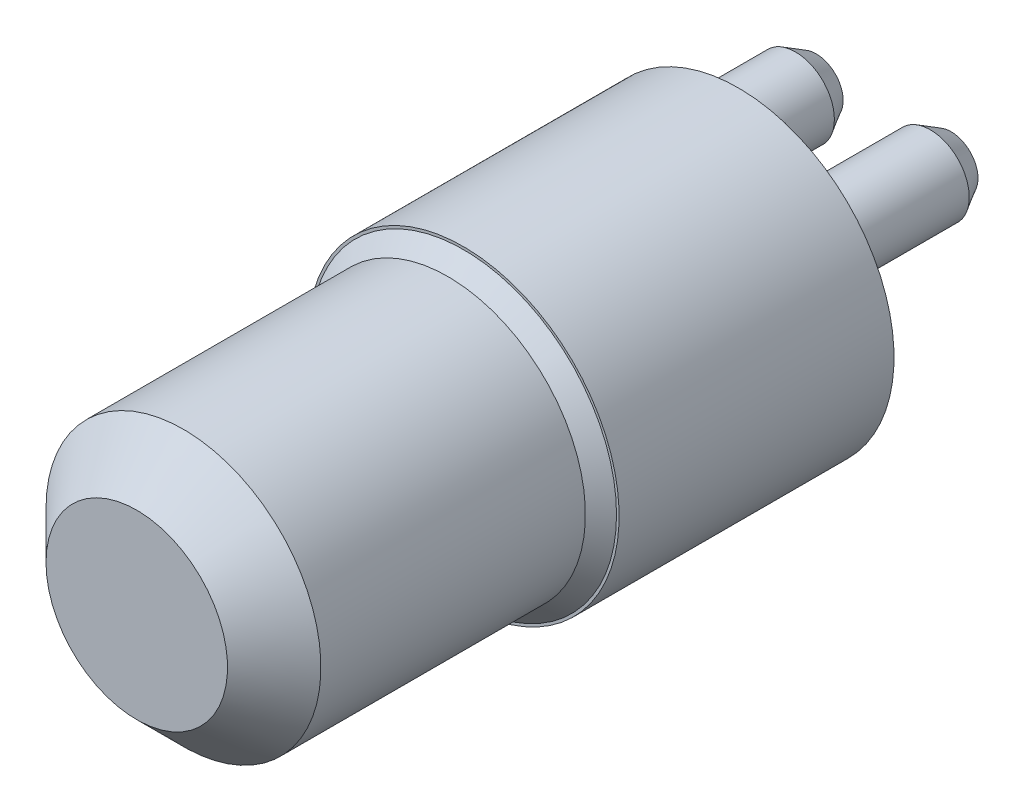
ISO-10303-21;
HEADER;
FILE_DESCRIPTION(('STEP AP214'),'2;1');
FILE_NAME('part.step','',(''),(''),'','','');
FILE_SCHEMA(('AUTOMOTIVE_DESIGN { 1 0 10303 214 1 1 1 1 }'));
ENDSEC;
DATA;
#1=APPLICATION_CONTEXT('core data for automotive mechanical design processes');
#2=APPLICATION_PROTOCOL_DEFINITION('international standard','automotive_design',2000,#1);
#3=PRODUCT_CONTEXT('',#1,'mechanical');
#4=PRODUCT('Part','Part','',(#3));
#5=PRODUCT_RELATED_PRODUCT_CATEGORY('part','',(#4));
#6=PRODUCT_DEFINITION_FORMATION('','',#4);
#7=PRODUCT_DEFINITION_CONTEXT('part definition',#1,'design');
#8=PRODUCT_DEFINITION('design','',#6,#7);
#9=PRODUCT_DEFINITION_SHAPE('','',#8);
#10=(LENGTH_UNIT() NAMED_UNIT(*) SI_UNIT(.MILLI.,.METRE.));
#11=(NAMED_UNIT(*) PLANE_ANGLE_UNIT() SI_UNIT($,.RADIAN.));
#12=(NAMED_UNIT(*) SI_UNIT($,.STERADIAN.) SOLID_ANGLE_UNIT());
#13=UNCERTAINTY_MEASURE_WITH_UNIT(LENGTH_MEASURE(1.E-05),#10,'distance_accuracy_value','');
#14=(GEOMETRIC_REPRESENTATION_CONTEXT(3) GLOBAL_UNCERTAINTY_ASSIGNED_CONTEXT((#13)) GLOBAL_UNIT_ASSIGNED_CONTEXT((#10,
#11,#12)) REPRESENTATION_CONTEXT('',''));
#15=CARTESIAN_POINT('',(0.,0.,0.));
#16=DIRECTION('',(0.,0.,1.));
#17=DIRECTION('',(1.,0.,0.));
#18=AXIS2_PLACEMENT_3D('',#15,#16,#17);
#19=CARTESIAN_POINT('',(0.,0.,0.));
#20=DIRECTION('',(0.,0.,0.999999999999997));
#21=DIRECTION('',(0.999999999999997,0.,0.));
#22=AXIS2_PLACEMENT_3D('',#19,#20,#21);
#23=PLANE('',#22);
#24=CARTESIAN_POINT('',(3.30199999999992,2.53999999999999,0.));
#25=DIRECTION('',(0.,0.,0.999999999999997));
#26=DIRECTION('',(0.999999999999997,0.,0.));
#27=AXIS2_PLACEMENT_3D('',#24,#25,#26);
#28=CIRCLE('',#27,1.905);
#29=CARTESIAN_POINT('',(5.20699999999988,2.54,0.));
#30=VERTEX_POINT('',#29);
#31=EDGE_CURVE('E57',#30,#30,#28,.F.);
#32=ORIENTED_EDGE('',*,*,#31,.F.);
#33=EDGE_LOOP('',(#32));
#34=FACE_BOUND('',#33,.T.);
#35=CARTESIAN_POINT('',(0.,0.,0.));
#36=DIRECTION('',(0.,0.,0.999999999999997));
#37=DIRECTION('',(0.999999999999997,0.,0.));
#38=AXIS2_PLACEMENT_3D('',#35,#36,#37);
#39=CIRCLE('',#38,7.62);
#40=CARTESIAN_POINT('',(-7.61999999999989,0.,0.));
#41=VERTEX_POINT('',#40);
#42=EDGE_CURVE('E67',#41,#41,#39,.T.);
#43=ORIENTED_EDGE('',*,*,#42,.F.);
#44=EDGE_LOOP('',(#43));
#45=FACE_BOUND('',#44,.T.);
#46=CARTESIAN_POINT('',(-3.30199999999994,2.54000000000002,0.));
#47=DIRECTION('',(0.,0.,0.999999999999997));
#48=DIRECTION('',(0.999999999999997,0.,0.));
#49=AXIS2_PLACEMENT_3D('',#46,#47,#48);
#50=CIRCLE('',#49,1.905);
#51=CARTESIAN_POINT('',(-1.397,2.54,0.));
#52=VERTEX_POINT('',#51);
#53=EDGE_CURVE('E54',#52,#52,#50,.F.);
#54=ORIENTED_EDGE('',*,*,#53,.F.);
#55=EDGE_LOOP('',(#54));
#56=FACE_BOUND('',#55,.T.);
#57=ADVANCED_FACE('F28',(#34,#45,#56),#23,.F.);
#58=CARTESIAN_POINT('',(0.,0.,13.462));
#59=DIRECTION('',(0.,0.,0.999999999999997));
#60=DIRECTION('',(0.999999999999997,0.,0.));
#61=AXIS2_PLACEMENT_3D('',#58,#59,#60);
#62=PLANE('',#61);
#63=CARTESIAN_POINT('',(0.,0.,13.462));
#64=DIRECTION('',(0.,0.,0.999999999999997));
#65=DIRECTION('',(0.999999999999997,0.,0.));
#66=AXIS2_PLACEMENT_3D('',#63,#64,#65);
#67=CIRCLE('',#66,7.49299999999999);
#68=CARTESIAN_POINT('',(-7.49299999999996,0.,13.462));
#69=VERTEX_POINT('',#68);
#70=EDGE_CURVE('E48',#69,#69,#67,.F.);
#71=ORIENTED_EDGE('',*,*,#70,.T.);
#72=EDGE_LOOP('',(#71));
#73=FACE_BOUND('',#72,.T.);
#74=CARTESIAN_POINT('',(0.,0.,13.462));
#75=DIRECTION('',(0.,0.,0.999999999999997));
#76=DIRECTION('',(0.999999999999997,0.,0.));
#77=AXIS2_PLACEMENT_3D('',#74,#75,#76);
#78=CIRCLE('',#77,7.62);
#79=CARTESIAN_POINT('',(-7.61999999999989,0.,13.462));
#80=VERTEX_POINT('',#79);
#81=EDGE_CURVE('E66',#80,#80,#78,.T.);
#82=ORIENTED_EDGE('',*,*,#81,.T.);
#83=EDGE_LOOP('',(#82));
#84=FACE_BOUND('',#83,.T.);
#85=ADVANCED_FACE('F73',(#73,#84),#62,.T.);
#86=CARTESIAN_POINT('',(0.,0.,13.462));
#87=DIRECTION('',(0.,0.,-0.999999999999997));
#88=DIRECTION('',(-0.999999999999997,0.,0.));
#89=AXIS2_PLACEMENT_3D('',#86,#87,#88);
#90=CYLINDRICAL_SURFACE('',#89,7.62);
#91=CARTESIAN_POINT('',(-7.61999999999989,0.,13.462));
#92=CARTESIAN_POINT('',(-7.61999999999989,0.,13.3217708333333));
#93=CARTESIAN_POINT('',(-7.61999999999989,0.,13.1815416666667));
#94=CARTESIAN_POINT('',(-7.61999999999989,0.,12.9010833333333));
#95=CARTESIAN_POINT('',(-7.61999999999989,0.,12.7608541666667));
#96=CARTESIAN_POINT('',(-7.61999999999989,0.,12.4803958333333));
#97=CARTESIAN_POINT('',(-7.61999999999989,0.,12.3401666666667));
#98=CARTESIAN_POINT('',(-7.61999999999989,0.,12.0597083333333));
#99=CARTESIAN_POINT('',(-7.61999999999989,0.,11.9194791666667));
#100=CARTESIAN_POINT('',(-7.61999999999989,0.,11.6390208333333));
#101=CARTESIAN_POINT('',(-7.61999999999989,0.,11.4987916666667));
#102=CARTESIAN_POINT('',(-7.61999999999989,0.,11.2183333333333));
#103=CARTESIAN_POINT('',(-7.61999999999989,0.,11.0781041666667));
#104=CARTESIAN_POINT('',(-7.61999999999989,0.,10.7976458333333));
#105=CARTESIAN_POINT('',(-7.61999999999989,0.,10.6574166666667));
#106=CARTESIAN_POINT('',(-7.61999999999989,0.,10.3769583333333));
#107=CARTESIAN_POINT('',(-7.61999999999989,0.,10.2367291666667));
#108=CARTESIAN_POINT('',(-7.61999999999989,0.,9.95627083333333));
#109=CARTESIAN_POINT('',(-7.61999999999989,0.,9.81604166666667));
#110=CARTESIAN_POINT('',(-7.61999999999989,0.,9.53558333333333));
#111=CARTESIAN_POINT('',(-7.61999999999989,0.,9.39535416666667));
#112=CARTESIAN_POINT('',(-7.61999999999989,0.,9.11489583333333));
#113=CARTESIAN_POINT('',(-7.61999999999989,0.,8.97466666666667));
#114=CARTESIAN_POINT('',(-7.61999999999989,0.,8.69420833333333));
#115=CARTESIAN_POINT('',(-7.61999999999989,0.,8.55397916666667));
#116=CARTESIAN_POINT('',(-7.61999999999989,0.,8.27352083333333));
#117=CARTESIAN_POINT('',(-7.61999999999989,0.,8.13329166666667));
#118=CARTESIAN_POINT('',(-7.61999999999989,0.,7.85283333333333));
#119=CARTESIAN_POINT('',(-7.61999999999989,0.,7.71260416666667));
#120=CARTESIAN_POINT('',(-7.61999999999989,0.,7.43214583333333));
#121=CARTESIAN_POINT('',(-7.61999999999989,0.,7.29191666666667));
#122=CARTESIAN_POINT('',(-7.61999999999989,0.,7.01145833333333));
#123=CARTESIAN_POINT('',(-7.61999999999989,0.,6.87122916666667));
#124=CARTESIAN_POINT('',(-7.61999999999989,0.,6.59077083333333));
#125=CARTESIAN_POINT('',(-7.61999999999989,0.,6.45054166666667));
#126=CARTESIAN_POINT('',(-7.61999999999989,0.,6.17008333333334));
#127=CARTESIAN_POINT('',(-7.61999999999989,0.,6.02985416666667));
#128=CARTESIAN_POINT('',(-7.61999999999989,0.,5.74939583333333));
#129=CARTESIAN_POINT('',(-7.61999999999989,0.,5.60916666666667));
#130=CARTESIAN_POINT('',(-7.61999999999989,0.,5.32870833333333));
#131=CARTESIAN_POINT('',(-7.61999999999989,0.,5.18847916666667));
#132=CARTESIAN_POINT('',(-7.61999999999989,0.,4.90802083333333));
#133=CARTESIAN_POINT('',(-7.61999999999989,0.,4.76779166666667));
#134=CARTESIAN_POINT('',(-7.61999999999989,0.,4.48733333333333));
#135=CARTESIAN_POINT('',(-7.61999999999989,0.,4.34710416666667));
#136=CARTESIAN_POINT('',(-7.61999999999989,0.,4.06664583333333));
#137=CARTESIAN_POINT('',(-7.61999999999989,0.,3.92641666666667));
#138=CARTESIAN_POINT('',(-7.61999999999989,0.,3.64595833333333));
#139=CARTESIAN_POINT('',(-7.61999999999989,0.,3.50572916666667));
#140=CARTESIAN_POINT('',(-7.61999999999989,0.,3.22527083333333));
#141=CARTESIAN_POINT('',(-7.61999999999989,0.,3.08504166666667));
#142=CARTESIAN_POINT('',(-7.61999999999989,0.,2.80458333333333));
#143=CARTESIAN_POINT('',(-7.61999999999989,0.,2.66435416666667));
#144=CARTESIAN_POINT('',(-7.61999999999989,0.,2.38389583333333));
#145=CARTESIAN_POINT('',(-7.61999999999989,0.,2.24366666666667));
#146=CARTESIAN_POINT('',(-7.61999999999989,0.,1.96320833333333));
#147=CARTESIAN_POINT('',(-7.61999999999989,0.,1.82297916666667));
#148=CARTESIAN_POINT('',(-7.61999999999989,0.,1.54252083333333));
#149=CARTESIAN_POINT('',(-7.61999999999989,0.,1.40229166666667));
#150=CARTESIAN_POINT('',(-7.61999999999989,0.,1.12183333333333));
#151=CARTESIAN_POINT('',(-7.61999999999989,0.,0.981604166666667));
#152=CARTESIAN_POINT('',(-7.61999999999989,0.,0.701145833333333));
#153=CARTESIAN_POINT('',(-7.61999999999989,0.,0.560916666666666));
#154=CARTESIAN_POINT('',(-7.61999999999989,0.,0.280458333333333));
#155=CARTESIAN_POINT('',(-7.61999999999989,0.,0.140229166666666));
#156=CARTESIAN_POINT('',(-7.61999999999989,0.,0.));
#157=B_SPLINE_CURVE_WITH_KNOTS('',3,(#91,#92,#93,#94,#95,#96,#97,#98,#99,#100,#101,#102,#103,
#104,#105,#106,#107,#108,#109,#110,#111,#112,#113,#114,#115,#116,#117,#118,#119,#120,#121,#122,
#123,#124,#125,#126,#127,#128,#129,#130,#131,#132,#133,#134,#135,#136,#137,#138,#139,#140,#141,
#142,#143,#144,#145,#146,#147,#148,#149,#150,#151,#152,#153,#154,#155,#156),.UNSPECIFIED.,.F.,
.F.,(4,2,2,2,2,2,2,2,2,2,2,2,2,2,2,2,2,2,2,2,2,2,2,2,2,2,2,2,2,2,2,2,4),(0.,0.420687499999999,
0.841374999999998,1.2620625,1.68275,2.1034375,2.524125,2.9448125,3.3655,3.7861875,4.206875,
4.6275625,5.04825,5.4689375,5.889625,6.3103125,6.731,7.1516875,7.572375,7.9930625,8.41375,
8.8344375,9.255125,9.6758125,10.0965,10.5171875,10.937875,11.3585625,11.77925,12.1999375,
12.620625,13.0413125,13.462),.UNSPECIFIED.);
#158=EDGE_CURVE('BSEAM75',#80,#41,#157,.T.);
#159=ORIENTED_EDGE('',*,*,#81,.F.);
#160=ORIENTED_EDGE('',*,*,#42,.T.);
#161=ORIENTED_EDGE('',*,*,#158,.T.);
#162=ORIENTED_EDGE('',*,*,#158,.F.);
#163=EDGE_LOOP('',(#159,#161,#160,#162));
#164=FACE_BOUND('',#163,.T.);
#165=ADVANCED_FACE('F75',(#164),#90,.T.);
#166=CARTESIAN_POINT('',(0.,0.,29.464));
#167=DIRECTION('',(0.,0.,-0.999999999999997));
#168=DIRECTION('',(-0.999999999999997,0.,0.));
#169=AXIS2_PLACEMENT_3D('',#166,#167,#168);
#170=CYLINDRICAL_SURFACE('',#169,6.731);
#171=CARTESIAN_POINT('',(0.,0.,14.224));
#172=DIRECTION('',(0.,0.,0.999999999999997));
#173=DIRECTION('',(0.999999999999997,0.,0.));
#174=AXIS2_PLACEMENT_3D('',#171,#172,#173);
#175=CIRCLE('',#174,6.731);
#176=CARTESIAN_POINT('',(-6.73099999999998,0.,14.224));
#177=VERTEX_POINT('',#176);
#178=EDGE_CURVE('E51',#177,#177,#175,.T.);
#179=CARTESIAN_POINT('',(0.,0.,27.178));
#180=DIRECTION('',(0.,0.,0.999999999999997));
#181=DIRECTION('',(0.999999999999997,0.,0.));
#182=AXIS2_PLACEMENT_3D('',#179,#180,#181);
#183=CIRCLE('',#182,6.731);
#184=CARTESIAN_POINT('',(-6.73099999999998,0.,27.178));
#185=VERTEX_POINT('',#184);
#186=EDGE_CURVE('E60',#185,#185,#183,.F.);
#187=CARTESIAN_POINT('',(-6.73099999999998,0.,14.224));
#188=CARTESIAN_POINT('',(-6.73099999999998,0.,14.3589375));
#189=CARTESIAN_POINT('',(-6.73099999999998,0.,14.493875));
#190=CARTESIAN_POINT('',(-6.73099999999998,0.,14.76375));
#191=CARTESIAN_POINT('',(-6.73099999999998,0.,14.8986875));
#192=CARTESIAN_POINT('',(-6.73099999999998,0.,15.1685625));
#193=CARTESIAN_POINT('',(-6.73099999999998,0.,15.3035));
#194=CARTESIAN_POINT('',(-6.73099999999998,0.,15.573375));
#195=CARTESIAN_POINT('',(-6.73099999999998,0.,15.7083125));
#196=CARTESIAN_POINT('',(-6.73099999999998,0.,15.9781875));
#197=CARTESIAN_POINT('',(-6.73099999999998,0.,16.113125));
#198=CARTESIAN_POINT('',(-6.73099999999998,0.,16.383));
#199=CARTESIAN_POINT('',(-6.73099999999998,0.,16.5179375));
#200=CARTESIAN_POINT('',(-6.73099999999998,0.,16.7878125));
#201=CARTESIAN_POINT('',(-6.73099999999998,0.,16.92275));
#202=CARTESIAN_POINT('',(-6.73099999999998,0.,17.192625));
#203=CARTESIAN_POINT('',(-6.73099999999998,0.,17.3275625));
#204=CARTESIAN_POINT('',(-6.73099999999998,0.,17.5974375));
#205=CARTESIAN_POINT('',(-6.73099999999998,0.,17.732375));
#206=CARTESIAN_POINT('',(-6.73099999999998,0.,18.00225));
#207=CARTESIAN_POINT('',(-6.73099999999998,0.,18.1371875));
#208=CARTESIAN_POINT('',(-6.73099999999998,0.,18.4070625));
#209=CARTESIAN_POINT('',(-6.73099999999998,0.,18.542));
#210=CARTESIAN_POINT('',(-6.73099999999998,0.,18.811875));
#211=CARTESIAN_POINT('',(-6.73099999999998,0.,18.9468125));
#212=CARTESIAN_POINT('',(-6.73099999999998,0.,19.2166875));
#213=CARTESIAN_POINT('',(-6.73099999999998,0.,19.351625));
#214=CARTESIAN_POINT('',(-6.73099999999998,0.,19.6215));
#215=CARTESIAN_POINT('',(-6.73099999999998,0.,19.7564375));
#216=CARTESIAN_POINT('',(-6.73099999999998,0.,20.0263125));
#217=CARTESIAN_POINT('',(-6.73099999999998,0.,20.16125));
#218=CARTESIAN_POINT('',(-6.73099999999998,0.,20.431125));
#219=CARTESIAN_POINT('',(-6.73099999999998,0.,20.5660625));
#220=CARTESIAN_POINT('',(-6.73099999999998,0.,20.8359375));
#221=CARTESIAN_POINT('',(-6.73099999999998,0.,20.970875));
#222=CARTESIAN_POINT('',(-6.73099999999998,0.,21.24075));
#223=CARTESIAN_POINT('',(-6.73099999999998,0.,21.3756875));
#224=CARTESIAN_POINT('',(-6.73099999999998,0.,21.6455625));
#225=CARTESIAN_POINT('',(-6.73099999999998,0.,21.7805));
#226=CARTESIAN_POINT('',(-6.73099999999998,0.,22.050375));
#227=CARTESIAN_POINT('',(-6.73099999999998,0.,22.1853125));
#228=CARTESIAN_POINT('',(-6.73099999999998,0.,22.4551875));
#229=CARTESIAN_POINT('',(-6.73099999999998,0.,22.590125));
#230=CARTESIAN_POINT('',(-6.73099999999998,0.,22.86));
#231=CARTESIAN_POINT('',(-6.73099999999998,0.,22.9949375));
#232=CARTESIAN_POINT('',(-6.73099999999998,0.,23.2648125));
#233=CARTESIAN_POINT('',(-6.73099999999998,0.,23.39975));
#234=CARTESIAN_POINT('',(-6.73099999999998,0.,23.669625));
#235=CARTESIAN_POINT('',(-6.73099999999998,0.,23.8045625));
#236=CARTESIAN_POINT('',(-6.73099999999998,0.,24.0744375));
#237=CARTESIAN_POINT('',(-6.73099999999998,0.,24.209375));
#238=CARTESIAN_POINT('',(-6.73099999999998,0.,24.47925));
#239=CARTESIAN_POINT('',(-6.73099999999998,0.,24.6141875));
#240=CARTESIAN_POINT('',(-6.73099999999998,0.,24.8840625));
#241=CARTESIAN_POINT('',(-6.73099999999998,0.,25.019));
#242=CARTESIAN_POINT('',(-6.73099999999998,0.,25.288875));
#243=CARTESIAN_POINT('',(-6.73099999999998,0.,25.4238125));
#244=CARTESIAN_POINT('',(-6.73099999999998,0.,25.6936875));
#245=CARTESIAN_POINT('',(-6.73099999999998,0.,25.828625));
#246=CARTESIAN_POINT('',(-6.73099999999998,0.,26.0985));
#247=CARTESIAN_POINT('',(-6.73099999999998,0.,26.2334375));
#248=CARTESIAN_POINT('',(-6.73099999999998,0.,26.5033125));
#249=CARTESIAN_POINT('',(-6.73099999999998,0.,26.63825));
#250=CARTESIAN_POINT('',(-6.73099999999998,0.,26.908125));
#251=CARTESIAN_POINT('',(-6.73099999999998,0.,27.0430625));
#252=CARTESIAN_POINT('',(-6.73099999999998,0.,27.178));
#253=B_SPLINE_CURVE_WITH_KNOTS('',3,(#187,#188,#189,#190,#191,#192,#193,#194,#195,#196,#197,
#198,#199,#200,#201,#202,#203,#204,#205,#206,#207,#208,#209,#210,#211,#212,#213,#214,#215,#216,
#217,#218,#219,#220,#221,#222,#223,#224,#225,#226,#227,#228,#229,#230,#231,#232,#233,#234,#235,
#236,#237,#238,#239,#240,#241,#242,#243,#244,#245,#246,#247,#248,#249,#250,#251,#252),
.UNSPECIFIED.,.F.,.F.,(4,2,2,2,2,2,2,2,2,2,2,2,2,2,2,2,2,2,2,2,2,2,2,2,2,2,2,2,2,2,2,2,4),(0.,
0.404812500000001,0.809624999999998,1.2144375,1.61925,2.02406249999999,2.42887499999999,
2.83368749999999,3.23849999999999,3.64331249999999,4.04812499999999,4.45293749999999,
4.85774999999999,5.26256249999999,5.66737499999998,6.07218749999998,6.47699999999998,
6.88181249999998,7.28662499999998,7.69143749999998,8.09624999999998,8.50106249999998,
8.90587499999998,9.31068749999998,9.71549999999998,10.1203125,10.525125,10.9299375,11.33475,
11.7395625,12.144375,12.5491875,12.954),.UNSPECIFIED.);
#254=EDGE_CURVE('BSEAM78',#177,#185,#253,.T.);
#255=ORIENTED_EDGE('',*,*,#178,.T.);
#256=ORIENTED_EDGE('',*,*,#186,.T.);
#257=ORIENTED_EDGE('',*,*,#254,.T.);
#258=ORIENTED_EDGE('',*,*,#254,.F.);
#259=EDGE_LOOP('',(#255,#257,#256,#258));
#260=FACE_BOUND('',#259,.T.);
#261=ADVANCED_FACE('F78',(#260),#170,.T.);
#262=CARTESIAN_POINT('',(0.,0.,29.464));
#263=DIRECTION('',(0.,0.,0.999999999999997));
#264=DIRECTION('',(0.999999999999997,0.,0.));
#265=AXIS2_PLACEMENT_3D('',#262,#263,#264);
#266=PLANE('',#265);
#267=CARTESIAN_POINT('',(0.,0.,29.464));
#268=DIRECTION('',(0.,0.,0.999999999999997));
#269=DIRECTION('',(0.999999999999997,0.,0.));
#270=AXIS2_PLACEMENT_3D('',#267,#268,#269);
#271=CIRCLE('',#270,4.44499999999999);
#272=CARTESIAN_POINT('',(-4.44499999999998,0.,29.464));
#273=VERTEX_POINT('',#272);
#274=EDGE_CURVE('E63',#273,#273,#271,.T.);
#275=ORIENTED_EDGE('',*,*,#274,.T.);
#276=EDGE_LOOP('',(#275));
#277=FACE_BOUND('',#276,.T.);
#278=ADVANCED_FACE('F107',(#277),#266,.T.);
#279=CARTESIAN_POINT('',(0.,0.,29.464));
#280=DIRECTION('',(0.,0.,-0.999999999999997));
#281=DIRECTION('',(-0.999999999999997,0.,0.));
#282=AXIS2_PLACEMENT_3D('',#279,#280,#281);
#283=CONICAL_SURFACE('',#282,4.44499999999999,0.785398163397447);
#284=CARTESIAN_POINT('',(-6.73099999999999,0.,27.178));
#285=CARTESIAN_POINT('',(-6.70718749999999,0.,27.2018125));
#286=CARTESIAN_POINT('',(-6.68337499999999,0.,27.225625));
#287=CARTESIAN_POINT('',(-6.63574999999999,0.,27.27325));
#288=CARTESIAN_POINT('',(-6.61193749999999,0.,27.2970625));
#289=CARTESIAN_POINT('',(-6.56431249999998,0.,27.3446875));
#290=CARTESIAN_POINT('',(-6.54049999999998,0.,27.3685));
#291=CARTESIAN_POINT('',(-6.49287499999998,0.,27.416125));
#292=CARTESIAN_POINT('',(-6.46906249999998,0.,27.4399375));
#293=CARTESIAN_POINT('',(-6.42143749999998,0.,27.4875625));
#294=CARTESIAN_POINT('',(-6.39762499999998,0.,27.511375));
#295=CARTESIAN_POINT('',(-6.34999999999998,0.,27.559));
#296=CARTESIAN_POINT('',(-6.32618749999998,0.,27.5828125));
#297=CARTESIAN_POINT('',(-6.27856249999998,0.,27.6304375));
#298=CARTESIAN_POINT('',(-6.25474999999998,0.,27.65425));
#299=CARTESIAN_POINT('',(-6.20712499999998,0.,27.701875));
#300=CARTESIAN_POINT('',(-6.18331249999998,0.,27.7256875));
#301=CARTESIAN_POINT('',(-6.13568749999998,0.,27.7733125));
#302=CARTESIAN_POINT('',(-6.11187499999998,0.,27.797125));
#303=CARTESIAN_POINT('',(-6.06424999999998,0.,27.84475));
#304=CARTESIAN_POINT('',(-6.04043749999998,0.,27.8685625));
#305=CARTESIAN_POINT('',(-5.99281249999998,0.,27.9161875));
#306=CARTESIAN_POINT('',(-5.96899999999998,0.,27.94));
#307=CARTESIAN_POINT('',(-5.92137499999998,0.,27.987625));
#308=CARTESIAN_POINT('',(-5.89756249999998,0.,28.0114375));
#309=CARTESIAN_POINT('',(-5.84993749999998,0.,28.0590625));
#310=CARTESIAN_POINT('',(-5.82612499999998,0.,28.082875));
#311=CARTESIAN_POINT('',(-5.77849999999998,0.,28.1305));
#312=CARTESIAN_POINT('',(-5.75468749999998,0.,28.1543125));
#313=CARTESIAN_POINT('',(-5.70706249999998,0.,28.2019375));
#314=CARTESIAN_POINT('',(-5.68324999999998,0.,28.22575));
#315=CARTESIAN_POINT('',(-5.63562499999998,0.,28.273375));
#316=CARTESIAN_POINT('',(-5.61181249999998,0.,28.2971875));
#317=CARTESIAN_POINT('',(-5.56418749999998,0.,28.3448125));
#318=CARTESIAN_POINT('',(-5.54037499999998,0.,28.368625));
#319=CARTESIAN_POINT('',(-5.49274999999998,0.,28.41625));
#320=CARTESIAN_POINT('',(-5.46893749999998,0.,28.4400625));
#321=CARTESIAN_POINT('',(-5.42131249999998,0.,28.4876875));
#322=CARTESIAN_POINT('',(-5.39749999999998,0.,28.5115));
#323=CARTESIAN_POINT('',(-5.34987499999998,0.,28.559125));
#324=CARTESIAN_POINT('',(-5.32606249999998,0.,28.5829375));
#325=CARTESIAN_POINT('',(-5.27843749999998,0.,28.6305625));
#326=CARTESIAN_POINT('',(-5.25462499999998,0.,28.654375));
#327=CARTESIAN_POINT('',(-5.20699999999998,0.,28.702));
#328=CARTESIAN_POINT('',(-5.18318749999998,0.,28.7258125));
#329=CARTESIAN_POINT('',(-5.13556249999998,0.,28.7734375));
#330=CARTESIAN_POINT('',(-5.11174999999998,0.,28.79725));
#331=CARTESIAN_POINT('',(-5.06412499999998,0.,28.844875));
#332=CARTESIAN_POINT('',(-5.04031249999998,0.,28.8686875));
#333=CARTESIAN_POINT('',(-4.99268749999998,0.,28.9163125));
#334=CARTESIAN_POINT('',(-4.96887499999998,0.,28.940125));
#335=CARTESIAN_POINT('',(-4.92124999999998,0.,28.98775));
#336=CARTESIAN_POINT('',(-4.89743749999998,0.,29.0115625));
#337=CARTESIAN_POINT('',(-4.84981249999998,0.,29.0591875));
#338=CARTESIAN_POINT('',(-4.82599999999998,0.,29.083));
#339=CARTESIAN_POINT('',(-4.77837499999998,0.,29.130625));
#340=CARTESIAN_POINT('',(-4.75456249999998,0.,29.1544375));
#341=CARTESIAN_POINT('',(-4.70693749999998,0.,29.2020625));
#342=CARTESIAN_POINT('',(-4.68312499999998,0.,29.225875));
#343=CARTESIAN_POINT('',(-4.63549999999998,0.,29.2735));
#344=CARTESIAN_POINT('',(-4.61168749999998,0.,29.2973125));
#345=CARTESIAN_POINT('',(-4.56406249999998,0.,29.3449375));
#346=CARTESIAN_POINT('',(-4.54024999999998,0.,29.36875));
#347=CARTESIAN_POINT('',(-4.49262499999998,0.,29.416375));
#348=CARTESIAN_POINT('',(-4.46881249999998,0.,29.4401875));
#349=CARTESIAN_POINT('',(-4.44499999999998,0.,29.464));
#350=B_SPLINE_CURVE_WITH_KNOTS('',3,(#284,#285,#286,#287,#288,#289,#290,#291,#292,#293,#294,
#295,#296,#297,#298,#299,#300,#301,#302,#303,#304,#305,#306,#307,#308,#309,#310,#311,#312,#313,
#314,#315,#316,#317,#318,#319,#320,#321,#322,#323,#324,#325,#326,#327,#328,#329,#330,#331,#332,
#333,#334,#335,#336,#337,#338,#339,#340,#341,#342,#343,#344,#345,#346,#347,#348,#349),
.UNSPECIFIED.,.F.,.F.,(4,2,2,2,2,2,2,2,2,2,2,2,2,2,2,2,2,2,2,2,2,2,2,2,2,2,2,2,2,2,2,2,4),(0.,
0.101027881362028,0.202055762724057,0.303083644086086,0.404111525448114,0.505139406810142,
0.606167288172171,0.707195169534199,0.808223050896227,0.909250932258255,1.01027881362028,
1.11130669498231,1.21233457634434,1.31336245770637,1.4143903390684,1.51541822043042,
1.61644610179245,1.71747398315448,1.81850186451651,1.91952974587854,2.02055762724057,
2.12158550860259,2.22261338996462,2.32364127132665,2.42466915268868,2.52569703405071,
2.62672491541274,2.72775279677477,2.82878067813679,2.92980855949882,3.03083644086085,
3.13186432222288,3.23289220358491),.UNSPECIFIED.);
#351=EDGE_CURVE('BSEAM106',#185,#273,#350,.T.);
#352=ORIENTED_EDGE('',*,*,#186,.F.);
#353=ORIENTED_EDGE('',*,*,#274,.F.);
#354=ORIENTED_EDGE('',*,*,#351,.T.);
#355=ORIENTED_EDGE('',*,*,#351,.F.);
#356=EDGE_LOOP('',(#352,#354,#353,#355));
#357=FACE_BOUND('',#356,.T.);
#358=ADVANCED_FACE('F106',(#357),#283,.T.);
#359=CARTESIAN_POINT('',(3.30199999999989,2.54,-7.11199999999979));
#360=DIRECTION('',(0.,0.,0.999999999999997));
#361=DIRECTION('',(0.999999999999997,0.,0.));
#362=AXIS2_PLACEMENT_3D('',#359,#360,#361);
#363=CYLINDRICAL_SURFACE('',#362,1.905);
#364=CARTESIAN_POINT('',(3.30199999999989,2.54,-6.0959999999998));
#365=DIRECTION('',(0.,0.,-0.999999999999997));
#366=DIRECTION('',(-0.999999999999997,0.,0.));
#367=AXIS2_PLACEMENT_3D('',#364,#365,#366);
#368=CIRCLE('',#367,1.905);
#369=CARTESIAN_POINT('',(5.20699999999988,2.54,-6.09599999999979));
#370=VERTEX_POINT('',#369);
#371=EDGE_CURVE('E10',#370,#370,#368,.F.);
#372=CARTESIAN_POINT('',(5.20699999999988,2.54,-6.09599999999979));
#373=CARTESIAN_POINT('',(5.20699999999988,2.54,-6.0324999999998));
#374=CARTESIAN_POINT('',(5.20699999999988,2.54,-5.9689999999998));
#375=CARTESIAN_POINT('',(5.20699999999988,2.54,-5.8419999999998));
#376=CARTESIAN_POINT('',(5.20699999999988,2.54,-5.77849999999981));
#377=CARTESIAN_POINT('',(5.20699999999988,2.54,-5.65149999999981));
#378=CARTESIAN_POINT('',(5.20699999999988,2.54,-5.58799999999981));
#379=CARTESIAN_POINT('',(5.20699999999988,2.54,-5.46099999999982));
#380=CARTESIAN_POINT('',(5.20699999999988,2.54,-5.39749999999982));
#381=CARTESIAN_POINT('',(5.20699999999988,2.54,-5.27049999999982));
#382=CARTESIAN_POINT('',(5.20699999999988,2.54,-5.20699999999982));
#383=CARTESIAN_POINT('',(5.20699999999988,2.54,-5.07999999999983));
#384=CARTESIAN_POINT('',(5.20699999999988,2.54,-5.01649999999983));
#385=CARTESIAN_POINT('',(5.20699999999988,2.54,-4.88949999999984));
#386=CARTESIAN_POINT('',(5.20699999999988,2.54,-4.82599999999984));
#387=CARTESIAN_POINT('',(5.20699999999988,2.54,-4.69899999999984));
#388=CARTESIAN_POINT('',(5.20699999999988,2.54,-4.63549999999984));
#389=CARTESIAN_POINT('',(5.20699999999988,2.54,-4.50849999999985));
#390=CARTESIAN_POINT('',(5.20699999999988,2.54,-4.44499999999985));
#391=CARTESIAN_POINT('',(5.20699999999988,2.54,-4.31799999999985));
#392=CARTESIAN_POINT('',(5.20699999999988,2.54,-4.25449999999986));
#393=CARTESIAN_POINT('',(5.20699999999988,2.54,-4.12749999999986));
#394=CARTESIAN_POINT('',(5.20699999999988,2.54,-4.06399999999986));
#395=CARTESIAN_POINT('',(5.20699999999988,2.54,-3.93699999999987));
#396=CARTESIAN_POINT('',(5.20699999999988,2.54,-3.87349999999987));
#397=CARTESIAN_POINT('',(5.20699999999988,2.54,-3.74649999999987));
#398=CARTESIAN_POINT('',(5.20699999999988,2.54,-3.68299999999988));
#399=CARTESIAN_POINT('',(5.20699999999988,2.54,-3.55599999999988));
#400=CARTESIAN_POINT('',(5.20699999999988,2.54,-3.49249999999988));
#401=CARTESIAN_POINT('',(5.20699999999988,2.54,-3.36549999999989));
#402=CARTESIAN_POINT('',(5.20699999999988,2.54,-3.30199999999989));
#403=CARTESIAN_POINT('',(5.20699999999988,2.54,-3.17499999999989));
#404=CARTESIAN_POINT('',(5.20699999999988,2.54,-3.1114999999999));
#405=CARTESIAN_POINT('',(5.20699999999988,2.54,-2.9844999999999));
#406=CARTESIAN_POINT('',(5.20699999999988,2.54,-2.9209999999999));
#407=CARTESIAN_POINT('',(5.20699999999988,2.54,-2.79399999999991));
#408=CARTESIAN_POINT('',(5.20699999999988,2.54,-2.73049999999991));
#409=CARTESIAN_POINT('',(5.20699999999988,2.54,-2.60349999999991));
#410=CARTESIAN_POINT('',(5.20699999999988,2.54,-2.53999999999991));
#411=CARTESIAN_POINT('',(5.20699999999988,2.54,-2.41299999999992));
#412=CARTESIAN_POINT('',(5.20699999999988,2.54,-2.34949999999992));
#413=CARTESIAN_POINT('',(5.20699999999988,2.54,-2.22249999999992));
#414=CARTESIAN_POINT('',(5.20699999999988,2.54,-2.15899999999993));
#415=CARTESIAN_POINT('',(5.20699999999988,2.54,-2.03199999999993));
#416=CARTESIAN_POINT('',(5.20699999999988,2.54,-1.96849999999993));
#417=CARTESIAN_POINT('',(5.20699999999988,2.54,-1.84149999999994));
#418=CARTESIAN_POINT('',(5.20699999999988,2.54,-1.77799999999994));
#419=CARTESIAN_POINT('',(5.20699999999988,2.54,-1.65099999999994));
#420=CARTESIAN_POINT('',(5.20699999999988,2.54,-1.58749999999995));
#421=CARTESIAN_POINT('',(5.20699999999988,2.54,-1.46049999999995));
#422=CARTESIAN_POINT('',(5.20699999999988,2.54,-1.39699999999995));
#423=CARTESIAN_POINT('',(5.20699999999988,2.54,-1.26999999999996));
#424=CARTESIAN_POINT('',(5.20699999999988,2.54,-1.20649999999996));
#425=CARTESIAN_POINT('',(5.20699999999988,2.54,-1.07949999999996));
#426=CARTESIAN_POINT('',(5.20699999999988,2.54,-1.01599999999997));
#427=CARTESIAN_POINT('',(5.20699999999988,2.54,-0.888999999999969));
#428=CARTESIAN_POINT('',(5.20699999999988,2.54,-0.825499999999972));
#429=CARTESIAN_POINT('',(5.20699999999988,2.54,-0.698499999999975));
#430=CARTESIAN_POINT('',(5.20699999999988,2.54,-0.634999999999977));
#431=CARTESIAN_POINT('',(5.20699999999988,2.54,-0.507999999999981));
#432=CARTESIAN_POINT('',(5.20699999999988,2.54,-0.444499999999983));
#433=CARTESIAN_POINT('',(5.20699999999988,2.54,-0.317499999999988));
#434=CARTESIAN_POINT('',(5.20699999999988,2.54,-0.253999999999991));
#435=CARTESIAN_POINT('',(5.20699999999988,2.54,-0.126999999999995));
#436=CARTESIAN_POINT('',(5.20699999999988,2.54,-0.0634999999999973));
#437=CARTESIAN_POINT('',(5.20699999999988,2.54,0.));
#438=B_SPLINE_CURVE_WITH_KNOTS('',3,(#372,#373,#374,#375,#376,#377,#378,#379,#380,#381,#382,
#383,#384,#385,#386,#387,#388,#389,#390,#391,#392,#393,#394,#395,#396,#397,#398,#399,#400,#401,
#402,#403,#404,#405,#406,#407,#408,#409,#410,#411,#412,#413,#414,#415,#416,#417,#418,#419,#420,
#421,#422,#423,#424,#425,#426,#427,#428,#429,#430,#431,#432,#433,#434,#435,#436,#437),
.UNSPECIFIED.,.F.,.F.,(4,2,2,2,2,2,2,2,2,2,2,2,2,2,2,2,2,2,2,2,2,2,2,2,2,2,2,2,2,2,2,2,4),(0.,
0.190499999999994,0.380999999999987,0.571499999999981,0.761999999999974,0.952499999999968,
1.14299999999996,1.33349999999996,1.52399999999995,1.71449999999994,1.90499999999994,
2.09549999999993,2.28599999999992,2.47649999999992,2.66699999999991,2.8574999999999,
3.0479999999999,3.23849999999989,3.42899999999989,3.61949999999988,3.80999999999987,
4.00049999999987,4.19099999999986,4.38149999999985,4.57199999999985,4.76249999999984,
4.95299999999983,5.14349999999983,5.33399999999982,5.52449999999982,5.71499999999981,
5.9054999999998,6.0959999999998),.UNSPECIFIED.);
#439=EDGE_CURVE('BSEAM101',#370,#30,#438,.T.);
#440=ORIENTED_EDGE('',*,*,#371,.T.);
#441=ORIENTED_EDGE('',*,*,#31,.T.);
#442=ORIENTED_EDGE('',*,*,#439,.T.);
#443=ORIENTED_EDGE('',*,*,#439,.F.);
#444=EDGE_LOOP('',(#440,#442,#441,#443));
#445=FACE_BOUND('',#444,.T.);
#446=ADVANCED_FACE('F101',(#445),#363,.T.);
#447=CARTESIAN_POINT('',(3.30199999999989,2.54,-7.11199999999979));
#448=DIRECTION('',(0.,0.,-0.999999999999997));
#449=DIRECTION('',(-0.999999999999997,0.,0.));
#450=AXIS2_PLACEMENT_3D('',#447,#448,#449);
#451=PLANE('',#450);
#452=CARTESIAN_POINT('',(3.30199999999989,2.54,-7.11199999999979));
#453=DIRECTION('',(0.,0.,-0.999999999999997));
#454=DIRECTION('',(-0.999999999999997,0.,0.));
#455=AXIS2_PLACEMENT_3D('',#452,#453,#454);
#456=CIRCLE('',#455,1.31841212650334);
#457=CARTESIAN_POINT('',(4.62041212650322,2.54,-7.11199999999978));
#458=VERTEX_POINT('',#457);
#459=EDGE_CURVE('E35',#458,#458,#456,.T.);
#460=ORIENTED_EDGE('',*,*,#459,.T.);
#461=EDGE_LOOP('',(#460));
#462=FACE_BOUND('',#461,.T.);
#463=ADVANCED_FACE('F91',(#462),#451,.T.);
#464=CARTESIAN_POINT('',(-3.30199999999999,2.54,-7.11200000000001));
#465=DIRECTION('',(0.,0.,0.999999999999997));
#466=DIRECTION('',(0.999999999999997,0.,0.));
#467=AXIS2_PLACEMENT_3D('',#464,#465,#466);
#468=CYLINDRICAL_SURFACE('',#467,1.905);
#469=CARTESIAN_POINT('',(-3.30199999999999,2.54,-6.09599999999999));
#470=DIRECTION('',(0.,0.,0.999999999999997));
#471=DIRECTION('',(0.999999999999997,0.,0.));
#472=AXIS2_PLACEMENT_3D('',#469,#470,#471);
#473=CIRCLE('',#472,1.905);
#474=CARTESIAN_POINT('',(-1.397,2.54,-6.09599999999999));
#475=VERTEX_POINT('',#474);
#476=EDGE_CURVE('E39',#475,#475,#473,.T.);
#477=CARTESIAN_POINT('',(-1.397,2.54,-6.09599999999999));
#478=CARTESIAN_POINT('',(-1.397,2.54,-6.03249999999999));
#479=CARTESIAN_POINT('',(-1.397,2.54,-5.96899999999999));
#480=CARTESIAN_POINT('',(-1.397,2.54,-5.84199999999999));
#481=CARTESIAN_POINT('',(-1.397,2.54,-5.77849999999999));
#482=CARTESIAN_POINT('',(-1.397,2.54,-5.65149999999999));
#483=CARTESIAN_POINT('',(-1.397,2.54,-5.58799999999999));
#484=CARTESIAN_POINT('',(-1.397,2.54,-5.46099999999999));
#485=CARTESIAN_POINT('',(-1.397,2.54,-5.39749999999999));
#486=CARTESIAN_POINT('',(-1.397,2.54,-5.27049999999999));
#487=CARTESIAN_POINT('',(-1.397,2.54,-5.20699999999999));
#488=CARTESIAN_POINT('',(-1.397,2.54,-5.07999999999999));
#489=CARTESIAN_POINT('',(-1.397,2.54,-5.01649999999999));
#490=CARTESIAN_POINT('',(-1.397,2.54,-4.88949999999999));
#491=CARTESIAN_POINT('',(-1.397,2.54,-4.82599999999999));
#492=CARTESIAN_POINT('',(-1.397,2.54,-4.69899999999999));
#493=CARTESIAN_POINT('',(-1.397,2.54,-4.63549999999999));
#494=CARTESIAN_POINT('',(-1.397,2.54,-4.50849999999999));
#495=CARTESIAN_POINT('',(-1.397,2.54,-4.44499999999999));
#496=CARTESIAN_POINT('',(-1.397,2.54,-4.31799999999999));
#497=CARTESIAN_POINT('',(-1.397,2.54,-4.25449999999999));
#498=CARTESIAN_POINT('',(-1.397,2.54,-4.12749999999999));
#499=CARTESIAN_POINT('',(-1.397,2.54,-4.06399999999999));
#500=CARTESIAN_POINT('',(-1.397,2.54,-3.93699999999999));
#501=CARTESIAN_POINT('',(-1.397,2.54,-3.87349999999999));
#502=CARTESIAN_POINT('',(-1.397,2.54,-3.74649999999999));
#503=CARTESIAN_POINT('',(-1.397,2.54,-3.68299999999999));
#504=CARTESIAN_POINT('',(-1.397,2.54,-3.55599999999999));
#505=CARTESIAN_POINT('',(-1.397,2.54,-3.49249999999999));
#506=CARTESIAN_POINT('',(-1.397,2.54,-3.36549999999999));
#507=CARTESIAN_POINT('',(-1.397,2.54,-3.30199999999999));
#508=CARTESIAN_POINT('',(-1.397,2.54,-3.17499999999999));
#509=CARTESIAN_POINT('',(-1.397,2.54,-3.11149999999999));
#510=CARTESIAN_POINT('',(-1.397,2.54,-2.98449999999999));
#511=CARTESIAN_POINT('',(-1.397,2.54,-2.92099999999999));
#512=CARTESIAN_POINT('',(-1.397,2.54,-2.79399999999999));
#513=CARTESIAN_POINT('',(-1.397,2.54,-2.73049999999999));
#514=CARTESIAN_POINT('',(-1.397,2.54,-2.6035));
#515=CARTESIAN_POINT('',(-1.397,2.54,-2.54));
#516=CARTESIAN_POINT('',(-1.397,2.54,-2.413));
#517=CARTESIAN_POINT('',(-1.397,2.54,-2.3495));
#518=CARTESIAN_POINT('',(-1.397,2.54,-2.2225));
#519=CARTESIAN_POINT('',(-1.397,2.54,-2.159));
#520=CARTESIAN_POINT('',(-1.397,2.54,-2.032));
#521=CARTESIAN_POINT('',(-1.397,2.54,-1.9685));
#522=CARTESIAN_POINT('',(-1.397,2.54,-1.8415));
#523=CARTESIAN_POINT('',(-1.397,2.54,-1.778));
#524=CARTESIAN_POINT('',(-1.397,2.54,-1.651));
#525=CARTESIAN_POINT('',(-1.397,2.54,-1.5875));
#526=CARTESIAN_POINT('',(-1.397,2.54,-1.4605));
#527=CARTESIAN_POINT('',(-1.397,2.54,-1.397));
#528=CARTESIAN_POINT('',(-1.397,2.54,-1.27));
#529=CARTESIAN_POINT('',(-1.397,2.54,-1.2065));
#530=CARTESIAN_POINT('',(-1.397,2.54,-1.0795));
#531=CARTESIAN_POINT('',(-1.397,2.54,-1.016));
#532=CARTESIAN_POINT('',(-1.397,2.54,-0.888999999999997));
#533=CARTESIAN_POINT('',(-1.397,2.54,-0.825499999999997));
#534=CARTESIAN_POINT('',(-1.397,2.54,-0.698499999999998));
#535=CARTESIAN_POINT('',(-1.397,2.54,-0.634999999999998));
#536=CARTESIAN_POINT('',(-1.397,2.54,-0.507999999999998));
#537=CARTESIAN_POINT('',(-1.397,2.54,-0.444499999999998));
#538=CARTESIAN_POINT('',(-1.397,2.54,-0.317499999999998));
#539=CARTESIAN_POINT('',(-1.397,2.54,-0.253999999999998));
#540=CARTESIAN_POINT('',(-1.397,2.54,-0.126999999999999));
#541=CARTESIAN_POINT('',(-1.397,2.54,-0.063499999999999));
#542=CARTESIAN_POINT('',(-1.397,2.54,0.));
#543=B_SPLINE_CURVE_WITH_KNOTS('',3,(#477,#478,#479,#480,#481,#482,#483,#484,#485,#486,#487,
#488,#489,#490,#491,#492,#493,#494,#495,#496,#497,#498,#499,#500,#501,#502,#503,#504,#505,#506,
#507,#508,#509,#510,#511,#512,#513,#514,#515,#516,#517,#518,#519,#520,#521,#522,#523,#524,#525,
#526,#527,#528,#529,#530,#531,#532,#533,#534,#535,#536,#537,#538,#539,#540,#541,#542),
.UNSPECIFIED.,.F.,.F.,(4,2,2,2,2,2,2,2,2,2,2,2,2,2,2,2,2,2,2,2,2,2,2,2,2,2,2,2,2,2,2,2,4),(0.,
0.1905,0.380999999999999,0.571499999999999,0.761999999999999,0.952499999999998,1.143,1.3335,
1.524,1.7145,1.905,2.0955,2.286,2.4765,2.667,2.8575,3.048,3.23849999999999,3.42899999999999,
3.61949999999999,3.80999999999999,4.00049999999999,4.19099999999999,4.38149999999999,
4.57199999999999,4.76249999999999,4.95299999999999,5.14349999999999,5.33399999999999,
5.52449999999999,5.71499999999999,5.90549999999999,6.09599999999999),.UNSPECIFIED.);
#544=EDGE_CURVE('BSEAM88',#475,#52,#543,.T.);
#545=ORIENTED_EDGE('',*,*,#476,.T.);
#546=ORIENTED_EDGE('',*,*,#53,.T.);
#547=ORIENTED_EDGE('',*,*,#544,.T.);
#548=ORIENTED_EDGE('',*,*,#544,.F.);
#549=EDGE_LOOP('',(#545,#547,#546,#548));
#550=FACE_BOUND('',#549,.T.);
#551=ADVANCED_FACE('F88',(#550),#468,.T.);
#552=CARTESIAN_POINT('',(-3.30199999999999,2.54,-7.11200000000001));
#553=DIRECTION('',(0.,0.,0.999999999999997));
#554=DIRECTION('',(0.999999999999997,0.,0.));
#555=AXIS2_PLACEMENT_3D('',#552,#553,#554);
#556=PLANE('',#555);
#557=CARTESIAN_POINT('',(-3.30199999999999,2.54,-7.11200000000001));
#558=DIRECTION('',(0.,0.,0.999999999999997));
#559=DIRECTION('',(0.999999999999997,0.,0.));
#560=AXIS2_PLACEMENT_3D('',#557,#558,#559);
#561=CIRCLE('',#560,1.31841212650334);
#562=CARTESIAN_POINT('',(-1.98358787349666,2.54,-7.11200000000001));
#563=VERTEX_POINT('',#562);
#564=EDGE_CURVE('E43',#563,#563,#561,.F.);
#565=ORIENTED_EDGE('',*,*,#564,.T.);
#566=EDGE_LOOP('',(#565));
#567=FACE_BOUND('',#566,.T.);
#568=ADVANCED_FACE('F90',(#567),#556,.F.);
#569=CARTESIAN_POINT('',(0.,0.,14.224));
#570=DIRECTION('',(0.,0.,-0.999999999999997));
#571=DIRECTION('',(-0.999999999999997,0.,0.));
#572=AXIS2_PLACEMENT_3D('',#569,#570,#571);
#573=CONICAL_SURFACE('',#572,6.731,0.785398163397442);
#574=CARTESIAN_POINT('',(-7.49299999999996,0.,13.462));
#575=CARTESIAN_POINT('',(-7.48506249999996,0.,13.4699375));
#576=CARTESIAN_POINT('',(-7.47712499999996,0.,13.477875));
#577=CARTESIAN_POINT('',(-7.46124999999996,0.,13.49375));
#578=CARTESIAN_POINT('',(-7.45331249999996,0.,13.5016875));
#579=CARTESIAN_POINT('',(-7.43743749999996,0.,13.5175625));
#580=CARTESIAN_POINT('',(-7.42949999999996,0.,13.5255));
#581=CARTESIAN_POINT('',(-7.41362499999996,0.,13.541375));
#582=CARTESIAN_POINT('',(-7.40568749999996,0.,13.5493125));
#583=CARTESIAN_POINT('',(-7.38981249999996,0.,13.5651875));
#584=CARTESIAN_POINT('',(-7.38187499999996,0.,13.573125));
#585=CARTESIAN_POINT('',(-7.36599999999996,0.,13.589));
#586=CARTESIAN_POINT('',(-7.35806249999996,0.,13.5969375));
#587=CARTESIAN_POINT('',(-7.34218749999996,0.,13.6128125));
#588=CARTESIAN_POINT('',(-7.33424999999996,0.,13.62075));
#589=CARTESIAN_POINT('',(-7.31837499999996,0.,13.636625));
#590=CARTESIAN_POINT('',(-7.31043749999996,0.,13.6445625));
#591=CARTESIAN_POINT('',(-7.29456249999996,0.,13.6604375));
#592=CARTESIAN_POINT('',(-7.28662499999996,0.,13.668375));
#593=CARTESIAN_POINT('',(-7.27074999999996,0.,13.68425));
#594=CARTESIAN_POINT('',(-7.26281249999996,0.,13.6921875));
#595=CARTESIAN_POINT('',(-7.24693749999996,0.,13.7080625));
#596=CARTESIAN_POINT('',(-7.23899999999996,0.,13.716));
#597=CARTESIAN_POINT('',(-7.22312499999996,0.,13.731875));
#598=CARTESIAN_POINT('',(-7.21518749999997,0.,13.7398125));
#599=CARTESIAN_POINT('',(-7.19931249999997,0.,13.7556875));
#600=CARTESIAN_POINT('',(-7.19137499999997,0.,13.763625));
#601=CARTESIAN_POINT('',(-7.17549999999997,0.,13.7795));
#602=CARTESIAN_POINT('',(-7.16756249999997,0.,13.7874375));
#603=CARTESIAN_POINT('',(-7.15168749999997,0.,13.8033125));
#604=CARTESIAN_POINT('',(-7.14374999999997,0.,13.81125));
#605=CARTESIAN_POINT('',(-7.12787499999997,0.,13.827125));
#606=CARTESIAN_POINT('',(-7.11993749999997,0.,13.8350625));
#607=CARTESIAN_POINT('',(-7.10406249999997,0.,13.8509375));
#608=CARTESIAN_POINT('',(-7.09612499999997,0.,13.858875));
#609=CARTESIAN_POINT('',(-7.08024999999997,0.,13.87475));
#610=CARTESIAN_POINT('',(-7.07231249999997,0.,13.8826875));
#611=CARTESIAN_POINT('',(-7.05643749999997,0.,13.8985625));
#612=CARTESIAN_POINT('',(-7.04849999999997,0.,13.9065));
#613=CARTESIAN_POINT('',(-7.03262499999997,0.,13.922375));
#614=CARTESIAN_POINT('',(-7.02468749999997,0.,13.9303125));
#615=CARTESIAN_POINT('',(-7.00881249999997,0.,13.9461875));
#616=CARTESIAN_POINT('',(-7.00087499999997,0.,13.954125));
#617=CARTESIAN_POINT('',(-6.98499999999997,0.,13.97));
#618=CARTESIAN_POINT('',(-6.97706249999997,0.,13.9779375));
#619=CARTESIAN_POINT('',(-6.96118749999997,0.,13.9938125));
#620=CARTESIAN_POINT('',(-6.95324999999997,0.,14.00175));
#621=CARTESIAN_POINT('',(-6.93737499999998,0.,14.017625));
#622=CARTESIAN_POINT('',(-6.92943749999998,0.,14.0255625));
#623=CARTESIAN_POINT('',(-6.91356249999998,0.,14.0414375));
#624=CARTESIAN_POINT('',(-6.90562499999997,0.,14.049375));
#625=CARTESIAN_POINT('',(-6.88974999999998,0.,14.06525));
#626=CARTESIAN_POINT('',(-6.88181249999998,0.,14.0731875));
#627=CARTESIAN_POINT('',(-6.86593749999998,0.,14.0890625));
#628=CARTESIAN_POINT('',(-6.85799999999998,0.,14.097));
#629=CARTESIAN_POINT('',(-6.84212499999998,0.,14.112875));
#630=CARTESIAN_POINT('',(-6.83418749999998,0.,14.1208125));
#631=CARTESIAN_POINT('',(-6.81831249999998,0.,14.1366875));
#632=CARTESIAN_POINT('',(-6.81037499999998,0.,14.144625));
#633=CARTESIAN_POINT('',(-6.79449999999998,0.,14.1605));
#634=CARTESIAN_POINT('',(-6.78656249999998,0.,14.1684375));
#635=CARTESIAN_POINT('',(-6.77068749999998,0.,14.1843125));
#636=CARTESIAN_POINT('',(-6.76274999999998,0.,14.19225));
#637=CARTESIAN_POINT('',(-6.74687499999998,0.,14.208125));
#638=CARTESIAN_POINT('',(-6.73893749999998,0.,14.2160625));
#639=CARTESIAN_POINT('',(-6.73099999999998,0.,14.224));
#640=B_SPLINE_CURVE_WITH_KNOTS('',3,(#574,#575,#576,#577,#578,#579,#580,#581,#582,#583,#584,
#585,#586,#587,#588,#589,#590,#591,#592,#593,#594,#595,#596,#597,#598,#599,#600,#601,#602,#603,
#604,#605,#606,#607,#608,#609,#610,#611,#612,#613,#614,#615,#616,#617,#618,#619,#620,#621,#622,
#623,#624,#625,#626,#627,#628,#629,#630,#631,#632,#633,#634,#635,#636,#637,#638,#639),
.UNSPECIFIED.,.F.,.F.,(4,2,2,2,2,2,2,2,2,2,2,2,2,2,2,2,2,2,2,2,2,2,2,2,2,2,2,2,2,2,2,2,4),(0.,
0.0336759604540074,0.0673519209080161,0.101027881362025,0.134703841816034,0.168379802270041,
0.202055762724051,0.235731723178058,0.269407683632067,0.303083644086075,0.336759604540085,
0.370435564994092,0.4041115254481,0.437787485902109,0.471463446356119,0.505139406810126,
0.538815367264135,0.572491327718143,0.606167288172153,0.639843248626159,0.673519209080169,
0.707195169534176,0.740871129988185,0.774547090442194,0.808223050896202,0.84189901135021,
0.87557497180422,0.909250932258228,0.942926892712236,0.976602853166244,1.01027881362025,
1.04395477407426,1.07763073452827),.UNSPECIFIED.);
#641=EDGE_CURVE('BSEAM98',#69,#177,#640,.T.);
#642=ORIENTED_EDGE('',*,*,#70,.F.);
#643=ORIENTED_EDGE('',*,*,#178,.F.);
#644=ORIENTED_EDGE('',*,*,#641,.T.);
#645=ORIENTED_EDGE('',*,*,#641,.F.);
#646=EDGE_LOOP('',(#642,#644,#643,#645));
#647=FACE_BOUND('',#646,.T.);
#648=ADVANCED_FACE('F98',(#647),#573,.T.);
#649=CARTESIAN_POINT('',(-3.30199999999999,2.54,-7.11200000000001));
#650=DIRECTION('',(0.,0.,0.999999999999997));
#651=DIRECTION('',(0.999999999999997,0.,0.));
#652=AXIS2_PLACEMENT_3D('',#649,#650,#651);
#653=CONICAL_SURFACE('',#652,1.31841212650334,0.523598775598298);
#654=CARTESIAN_POINT('',(-1.39699999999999,2.54,-6.09599999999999));
#655=CARTESIAN_POINT('',(-1.40311029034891,2.54,-6.10658333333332));
#656=CARTESIAN_POINT('',(-1.40922058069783,2.54,-6.11716666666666));
#657=CARTESIAN_POINT('',(-1.42144116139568,2.54,-6.13833333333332));
#658=CARTESIAN_POINT('',(-1.42755145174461,2.54,-6.14891666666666));
#659=CARTESIAN_POINT('',(-1.43977203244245,2.54,-6.17008333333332));
#660=CARTESIAN_POINT('',(-1.44588232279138,2.54,-6.18066666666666));
#661=CARTESIAN_POINT('',(-1.45810290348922,2.54,-6.20183333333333));
#662=CARTESIAN_POINT('',(-1.46421319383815,2.54,-6.21241666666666));
#663=CARTESIAN_POINT('',(-1.47643377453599,2.54,-6.23358333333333));
#664=CARTESIAN_POINT('',(-1.48254406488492,2.54,-6.24416666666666));
#665=CARTESIAN_POINT('',(-1.49476464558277,2.54,-6.26533333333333));
#666=CARTESIAN_POINT('',(-1.50087493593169,2.54,-6.27591666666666));
#667=CARTESIAN_POINT('',(-1.51309551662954,2.54,-6.29708333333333));
#668=CARTESIAN_POINT('',(-1.51920580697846,2.54,-6.30766666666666));
#669=CARTESIAN_POINT('',(-1.53142638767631,2.54,-6.32883333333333));
#670=CARTESIAN_POINT('',(-1.53753667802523,2.54,-6.33941666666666));
#671=CARTESIAN_POINT('',(-1.54975725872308,2.54,-6.36058333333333));
#672=CARTESIAN_POINT('',(-1.555867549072,2.54,-6.37116666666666));
#673=CARTESIAN_POINT('',(-1.56808812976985,2.54,-6.39233333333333));
#674=CARTESIAN_POINT('',(-1.57419842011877,2.54,-6.40291666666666));
#675=CARTESIAN_POINT('',(-1.58641900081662,2.54,-6.42408333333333));
#676=CARTESIAN_POINT('',(-1.59252929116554,2.54,-6.43466666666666));
#677=CARTESIAN_POINT('',(-1.60474987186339,2.54,-6.45583333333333));
#678=CARTESIAN_POINT('',(-1.61086016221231,2.54,-6.46641666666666));
#679=CARTESIAN_POINT('',(-1.62308074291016,2.54,-6.48758333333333));
#680=CARTESIAN_POINT('',(-1.62919103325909,2.54,-6.49816666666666));
#681=CARTESIAN_POINT('',(-1.64141161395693,2.54,-6.51933333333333));
#682=CARTESIAN_POINT('',(-1.64752190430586,2.54,-6.52991666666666));
#683=CARTESIAN_POINT('',(-1.6597424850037,2.54,-6.55108333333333));
#684=CARTESIAN_POINT('',(-1.66585277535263,2.54,-6.56166666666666));
#685=CARTESIAN_POINT('',(-1.67807335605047,2.54,-6.58283333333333));
#686=CARTESIAN_POINT('',(-1.6841836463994,2.54,-6.59341666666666));
#687=CARTESIAN_POINT('',(-1.69640422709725,2.54,-6.61458333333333));
#688=CARTESIAN_POINT('',(-1.70251451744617,2.54,-6.62516666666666));
#689=CARTESIAN_POINT('',(-1.71473509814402,2.54,-6.64633333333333));
#690=CARTESIAN_POINT('',(-1.72084538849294,2.54,-6.65691666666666));
#691=CARTESIAN_POINT('',(-1.73306596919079,2.54,-6.67808333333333));
#692=CARTESIAN_POINT('',(-1.73917625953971,2.54,-6.68866666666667));
#693=CARTESIAN_POINT('',(-1.75139684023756,2.54,-6.70983333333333));
#694=CARTESIAN_POINT('',(-1.75750713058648,2.54,-6.72041666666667));
#695=CARTESIAN_POINT('',(-1.76972771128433,2.54,-6.74158333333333));
#696=CARTESIAN_POINT('',(-1.77583800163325,2.54,-6.75216666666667));
#697=CARTESIAN_POINT('',(-1.7880585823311,2.54,-6.77333333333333));
#698=CARTESIAN_POINT('',(-1.79416887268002,2.54,-6.78391666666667));
#699=CARTESIAN_POINT('',(-1.80638945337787,2.54,-6.80508333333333));
#700=CARTESIAN_POINT('',(-1.81249974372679,2.54,-6.81566666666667));
#701=CARTESIAN_POINT('',(-1.82472032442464,2.54,-6.83683333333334));
#702=CARTESIAN_POINT('',(-1.83083061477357,2.54,-6.84741666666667));
#703=CARTESIAN_POINT('',(-1.84305119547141,2.54,-6.86858333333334));
#704=CARTESIAN_POINT('',(-1.84916148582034,2.54,-6.87916666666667));
#705=CARTESIAN_POINT('',(-1.86138206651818,2.54,-6.90033333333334));
#706=CARTESIAN_POINT('',(-1.86749235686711,2.54,-6.91091666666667));
#707=CARTESIAN_POINT('',(-1.87971293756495,2.54,-6.93208333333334));
#708=CARTESIAN_POINT('',(-1.88582322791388,2.54,-6.94266666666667));
#709=CARTESIAN_POINT('',(-1.89804380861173,2.54,-6.96383333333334));
#710=CARTESIAN_POINT('',(-1.90415409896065,2.54,-6.97441666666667));
#711=CARTESIAN_POINT('',(-1.9163746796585,2.54,-6.99558333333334));
#712=CARTESIAN_POINT('',(-1.92248497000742,2.54,-7.00616666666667));
#713=CARTESIAN_POINT('',(-1.93470555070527,2.54,-7.02733333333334));
#714=CARTESIAN_POINT('',(-1.94081584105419,2.54,-7.03791666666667));
#715=CARTESIAN_POINT('',(-1.95303642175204,2.54,-7.05908333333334));
#716=CARTESIAN_POINT('',(-1.95914671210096,2.54,-7.06966666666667));
#717=CARTESIAN_POINT('',(-1.97136729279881,2.54,-7.09083333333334));
#718=CARTESIAN_POINT('',(-1.97747758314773,2.54,-7.10141666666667));
#719=CARTESIAN_POINT('',(-1.98358787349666,2.54,-7.11200000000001));
#720=B_SPLINE_CURVE_WITH_KNOTS('',3,(#654,#655,#656,#657,#658,#659,#660,#661,#662,#663,#664,
#665,#666,#667,#668,#669,#670,#671,#672,#673,#674,#675,#676,#677,#678,#679,#680,#681,#682,#683,
#684,#685,#686,#687,#688,#689,#690,#691,#692,#693,#694,#695,#696,#697,#698,#699,#700,#701,#702,
#703,#704,#705,#706,#707,#708,#709,#710,#711,#712,#713,#714,#715,#716,#717,#718,#719),
.UNSPECIFIED.,.F.,.F.,(4,2,2,2,2,2,2,2,2,2,2,2,2,2,2,2,2,2,2,2,2,2,2,2,2,2,2,2,2,2,2,2,4),(0.,
0.0366617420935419,0.0733234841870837,0.109985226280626,0.146646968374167,0.183308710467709,
0.219970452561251,0.256632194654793,0.293293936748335,0.329955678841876,0.366617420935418,
0.40327916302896,0.439940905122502,0.476602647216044,0.513264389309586,0.549926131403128,
0.586587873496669,0.623249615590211,0.659911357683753,0.696573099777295,0.733234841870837,
0.769896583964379,0.80655832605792,0.843220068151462,0.879881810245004,0.916543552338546,
0.953205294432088,0.98986703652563,1.02652877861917,1.06319052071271,1.09985226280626,
1.1365140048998,1.17317574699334),.UNSPECIFIED.);
#721=EDGE_CURVE('BSEAM121',#475,#563,#720,.T.);
#722=ORIENTED_EDGE('',*,*,#476,.F.);
#723=ORIENTED_EDGE('',*,*,#564,.F.);
#724=ORIENTED_EDGE('',*,*,#721,.T.);
#725=ORIENTED_EDGE('',*,*,#721,.F.);
#726=EDGE_LOOP('',(#722,#724,#723,#725));
#727=FACE_BOUND('',#726,.T.);
#728=ADVANCED_FACE('F121',(#727),#653,.T.);
#729=CARTESIAN_POINT('',(3.30199999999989,2.54,-7.11199999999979));
#730=DIRECTION('',(0.,0.,0.999999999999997));
#731=DIRECTION('',(0.999999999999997,0.,0.));
#732=AXIS2_PLACEMENT_3D('',#729,#730,#731);
#733=CONICAL_SURFACE('',#732,1.31841212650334,0.523598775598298);
#734=CARTESIAN_POINT('',(5.20699999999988,2.54,-6.09599999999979));
#735=CARTESIAN_POINT('',(5.20088970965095,2.54,-6.10658333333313));
#736=CARTESIAN_POINT('',(5.19477941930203,2.54,-6.11716666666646));
#737=CARTESIAN_POINT('',(5.18255883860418,2.54,-6.13833333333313));
#738=CARTESIAN_POINT('',(5.17644854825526,2.54,-6.14891666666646));
#739=CARTESIAN_POINT('',(5.16422796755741,2.54,-6.17008333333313));
#740=CARTESIAN_POINT('',(5.15811767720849,2.54,-6.18066666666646));
#741=CARTESIAN_POINT('',(5.14589709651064,2.54,-6.20183333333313));
#742=CARTESIAN_POINT('',(5.13978680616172,2.54,-6.21241666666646));
#743=CARTESIAN_POINT('',(5.12756622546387,2.54,-6.23358333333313));
#744=CARTESIAN_POINT('',(5.12145593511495,2.54,-6.24416666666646));
#745=CARTESIAN_POINT('',(5.1092353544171,2.54,-6.26533333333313));
#746=CARTESIAN_POINT('',(5.10312506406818,2.54,-6.27591666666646));
#747=CARTESIAN_POINT('',(5.09090448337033,2.54,-6.29708333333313));
#748=CARTESIAN_POINT('',(5.08479419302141,2.54,-6.30766666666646));
#749=CARTESIAN_POINT('',(5.07257361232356,2.54,-6.32883333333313));
#750=CARTESIAN_POINT('',(5.06646332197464,2.54,-6.33941666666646));
#751=CARTESIAN_POINT('',(5.05424274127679,2.54,-6.36058333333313));
#752=CARTESIAN_POINT('',(5.04813245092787,2.54,-6.37116666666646));
#753=CARTESIAN_POINT('',(5.03591187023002,2.54,-6.39233333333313));
#754=CARTESIAN_POINT('',(5.0298015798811,2.54,-6.40291666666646));
#755=CARTESIAN_POINT('',(5.01758099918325,2.54,-6.42408333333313));
#756=CARTESIAN_POINT('',(5.01147070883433,2.54,-6.43466666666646));
#757=CARTESIAN_POINT('',(4.99925012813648,2.54,-6.45583333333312));
#758=CARTESIAN_POINT('',(4.99313983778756,2.54,-6.46641666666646));
#759=CARTESIAN_POINT('',(4.98091925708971,2.54,-6.48758333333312));
#760=CARTESIAN_POINT('',(4.97480896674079,2.54,-6.49816666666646));
#761=CARTESIAN_POINT('',(4.96258838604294,2.54,-6.51933333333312));
#762=CARTESIAN_POINT('',(4.95647809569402,2.54,-6.52991666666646));
#763=CARTESIAN_POINT('',(4.94425751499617,2.54,-6.55108333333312));
#764=CARTESIAN_POINT('',(4.93814722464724,2.54,-6.56166666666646));
#765=CARTESIAN_POINT('',(4.9259266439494,2.54,-6.58283333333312));
#766=CARTESIAN_POINT('',(4.91981635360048,2.54,-6.59341666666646));
#767=CARTESIAN_POINT('',(4.90759577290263,2.54,-6.61458333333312));
#768=CARTESIAN_POINT('',(4.9014854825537,2.54,-6.62516666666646));
#769=CARTESIAN_POINT('',(4.88926490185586,2.54,-6.64633333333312));
#770=CARTESIAN_POINT('',(4.88315461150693,2.54,-6.65691666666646));
#771=CARTESIAN_POINT('',(4.87093403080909,2.54,-6.67808333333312));
#772=CARTESIAN_POINT('',(4.86482374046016,2.54,-6.68866666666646));
#773=CARTESIAN_POINT('',(4.85260315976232,2.54,-6.70983333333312));
#774=CARTESIAN_POINT('',(4.84649286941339,2.54,-6.72041666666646));
#775=CARTESIAN_POINT('',(4.83427228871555,2.54,-6.74158333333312));
#776=CARTESIAN_POINT('',(4.82816199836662,2.54,-6.75216666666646));
#777=CARTESIAN_POINT('',(4.81594141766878,2.54,-6.77333333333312));
#778=CARTESIAN_POINT('',(4.80983112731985,2.54,-6.78391666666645));
#779=CARTESIAN_POINT('',(4.79761054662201,2.54,-6.80508333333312));
#780=CARTESIAN_POINT('',(4.79150025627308,2.54,-6.81566666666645));
#781=CARTESIAN_POINT('',(4.77927967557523,2.54,-6.83683333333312));
#782=CARTESIAN_POINT('',(4.77316938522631,2.54,-6.84741666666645));
#783=CARTESIAN_POINT('',(4.76094880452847,2.54,-6.86858333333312));
#784=CARTESIAN_POINT('',(4.75483851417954,2.54,-6.87916666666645));
#785=CARTESIAN_POINT('',(4.74261793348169,2.54,-6.90033333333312));
#786=CARTESIAN_POINT('',(4.73650764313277,2.54,-6.91091666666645));
#787=CARTESIAN_POINT('',(4.72428706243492,2.54,-6.93208333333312));
#788=CARTESIAN_POINT('',(4.718176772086,2.54,-6.94266666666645));
#789=CARTESIAN_POINT('',(4.70595619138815,2.54,-6.96383333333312));
#790=CARTESIAN_POINT('',(4.69984590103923,2.54,-6.97441666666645));
#791=CARTESIAN_POINT('',(4.68762532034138,2.54,-6.99558333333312));
#792=CARTESIAN_POINT('',(4.68151502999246,2.54,-7.00616666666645));
#793=CARTESIAN_POINT('',(4.66929444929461,2.54,-7.02733333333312));
#794=CARTESIAN_POINT('',(4.66318415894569,2.54,-7.03791666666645));
#795=CARTESIAN_POINT('',(4.65096357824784,2.54,-7.05908333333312));
#796=CARTESIAN_POINT('',(4.64485328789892,2.54,-7.06966666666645));
#797=CARTESIAN_POINT('',(4.63263270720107,2.54,-7.09083333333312));
#798=CARTESIAN_POINT('',(4.62652241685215,2.54,-7.10141666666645));
#799=CARTESIAN_POINT('',(4.62041212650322,2.54,-7.11199999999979));
#800=B_SPLINE_CURVE_WITH_KNOTS('',3,(#734,#735,#736,#737,#738,#739,#740,#741,#742,#743,#744,
#745,#746,#747,#748,#749,#750,#751,#752,#753,#754,#755,#756,#757,#758,#759,#760,#761,#762,#763,
#764,#765,#766,#767,#768,#769,#770,#771,#772,#773,#774,#775,#776,#777,#778,#779,#780,#781,#782,
#783,#784,#785,#786,#787,#788,#789,#790,#791,#792,#793,#794,#795,#796,#797,#798,#799),
.UNSPECIFIED.,.F.,.F.,(4,2,2,2,2,2,2,2,2,2,2,2,2,2,2,2,2,2,2,2,2,2,2,2,2,2,2,2,2,2,2,2,4),(0.,
0.036661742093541,0.073323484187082,0.109985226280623,0.146646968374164,0.183308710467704,
0.219970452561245,0.256632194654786,0.293293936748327,0.329955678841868,0.366617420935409,
0.403279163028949,0.43994090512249,0.476602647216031,0.513264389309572,0.549926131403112,
0.586587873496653,0.623249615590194,0.659911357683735,0.696573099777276,0.733234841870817,
0.769896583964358,0.806558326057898,0.843220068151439,0.87988181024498,0.916543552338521,
0.953205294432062,0.989867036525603,1.02652877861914,1.06319052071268,1.09985226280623,
1.13651400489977,1.17317574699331),.UNSPECIFIED.);
#801=EDGE_CURVE('BSEAM30',#370,#458,#800,.T.);
#802=ORIENTED_EDGE('',*,*,#371,.F.);
#803=ORIENTED_EDGE('',*,*,#459,.F.);
#804=ORIENTED_EDGE('',*,*,#801,.T.);
#805=ORIENTED_EDGE('',*,*,#801,.F.);
#806=EDGE_LOOP('',(#802,#804,#803,#805));
#807=FACE_BOUND('',#806,.T.);
#808=ADVANCED_FACE('F30',(#807),#733,.T.);
#809=CLOSED_SHELL('',(#57,#85,#165,#261,#278,#358,#446,#463,#551,#568,#648,#728,#808));
#810=MANIFOLD_SOLID_BREP('B2',#809);
#811=ADVANCED_BREP_SHAPE_REPRESENTATION('',(#18,#810),#14);
#812=SHAPE_DEFINITION_REPRESENTATION(#9,#811);
ENDSEC;
END-ISO-10303-21;
